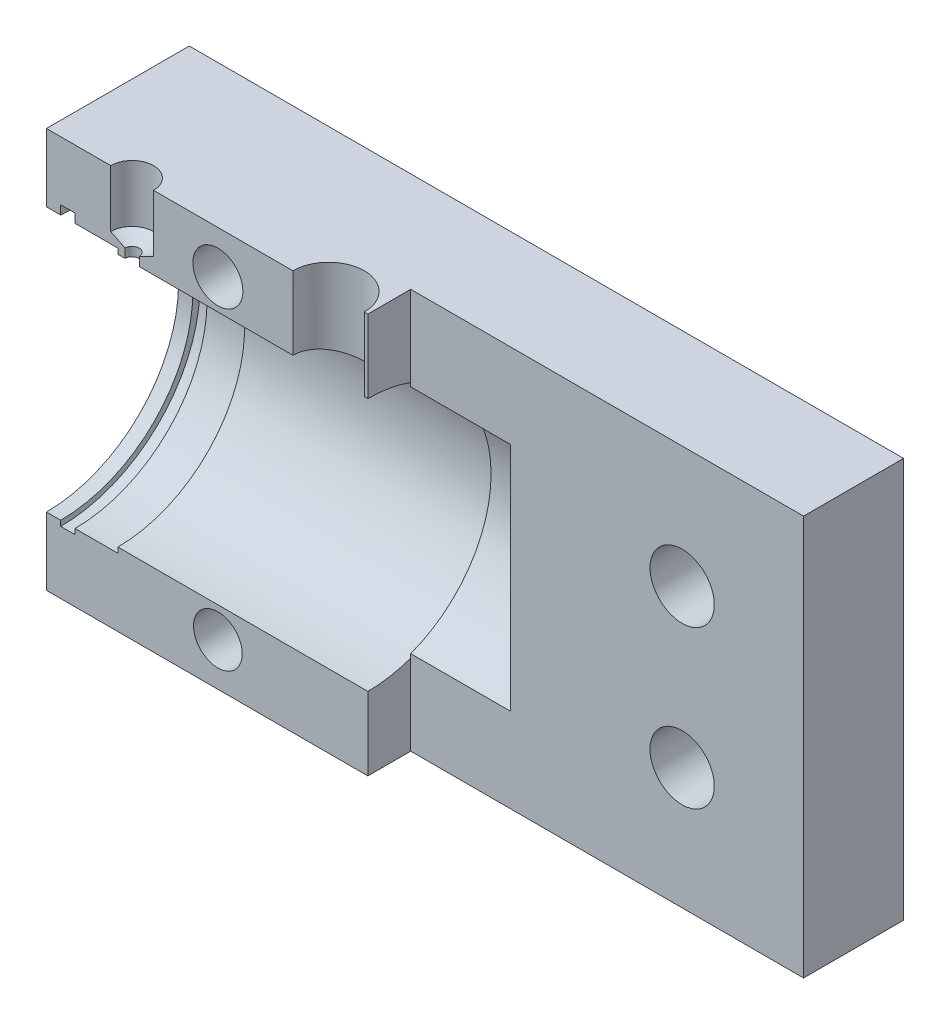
ISO-10303-21;
HEADER;
FILE_DESCRIPTION(('STEP AP214'),'2;1');
FILE_NAME('part.step','',(''),(''),'','','');
FILE_SCHEMA(('AUTOMOTIVE_DESIGN { 1 0 10303 214 1 1 1 1 }'));
ENDSEC;
DATA;
#1=APPLICATION_CONTEXT('core data for automotive mechanical design processes');
#2=APPLICATION_PROTOCOL_DEFINITION('international standard','automotive_design',2000,#1);
#3=PRODUCT_CONTEXT('',#1,'mechanical');
#4=PRODUCT('Part','Part','',(#3));
#5=PRODUCT_RELATED_PRODUCT_CATEGORY('part','',(#4));
#6=PRODUCT_DEFINITION_FORMATION('','',#4);
#7=PRODUCT_DEFINITION_CONTEXT('part definition',#1,'design');
#8=PRODUCT_DEFINITION('design','',#6,#7);
#9=PRODUCT_DEFINITION_SHAPE('','',#8);
#10=(LENGTH_UNIT() NAMED_UNIT(*) SI_UNIT(.MILLI.,.METRE.));
#11=(NAMED_UNIT(*) PLANE_ANGLE_UNIT() SI_UNIT($,.RADIAN.));
#12=(NAMED_UNIT(*) SI_UNIT($,.STERADIAN.) SOLID_ANGLE_UNIT());
#13=UNCERTAINTY_MEASURE_WITH_UNIT(LENGTH_MEASURE(1.E-05),#10,'distance_accuracy_value','');
#14=(GEOMETRIC_REPRESENTATION_CONTEXT(3) GLOBAL_UNCERTAINTY_ASSIGNED_CONTEXT((#13)) GLOBAL_UNIT_ASSIGNED_CONTEXT((#10,
#11,#12)) REPRESENTATION_CONTEXT('',''));
#15=CARTESIAN_POINT('',(0.,0.,0.));
#16=DIRECTION('',(0.,0.,1.));
#17=DIRECTION('',(1.,0.,0.));
#18=AXIS2_PLACEMENT_3D('',#15,#16,#17);
#19=CARTESIAN_POINT('',(-30.,40.,40.));
#20=DIRECTION('',(1.,0.,0.));
#21=DIRECTION('',(0.,0.,-1.));
#22=AXIS2_PLACEMENT_3D('',#19,#20,#21);
#23=PLANE('',#22);
#24=DIRECTION('',(0.,0.,-1.));
#25=VECTOR('',#24,1.);
#26=CARTESIAN_POINT('',(-30.,-16.,40.));
#27=LINE('',#26,#25);
#28=CARTESIAN_POINT('',(-30.,-16.,20.));
#29=VERTEX_POINT('',#28);
#30=CARTESIAN_POINT('',(-30.,-16.,0.));
#31=VERTEX_POINT('',#30);
#32=EDGE_CURVE('E258',#29,#31,#27,.T.);
#33=ORIENTED_EDGE('',*,*,#32,.F.);
#34=DIRECTION('',(0.,-1.,0.));
#35=VECTOR('',#34,1.);
#36=CARTESIAN_POINT('',(-30.,40.,20.));
#37=LINE('',#36,#35);
#38=CARTESIAN_POINT('',(-30.,-6.49999999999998,20.));
#39=VERTEX_POINT('',#38);
#40=EDGE_CURVE('E333',#39,#29,#37,.T.);
#41=ORIENTED_EDGE('',*,*,#40,.F.);
#42=CARTESIAN_POINT('',(-30.,12.,20.));
#43=DIRECTION('',(-1.,0.,0.));
#44=DIRECTION('',(0.,0.,1.));
#45=AXIS2_PLACEMENT_3D('',#42,#43,#44);
#46=CIRCLE('',#45,18.5);
#47=CARTESIAN_POINT('',(-30.,30.5,20.));
#48=VERTEX_POINT('',#47);
#49=EDGE_CURVE('E229',#48,#39,#46,.T.);
#50=ORIENTED_EDGE('',*,*,#49,.F.);
#51=CARTESIAN_POINT('',(-30.,40.,20.));
#52=VERTEX_POINT('',#51);
#53=EDGE_CURVE('E330',#52,#48,#37,.T.);
#54=ORIENTED_EDGE('',*,*,#53,.F.);
#55=DIRECTION('',(0.,0.,-1.));
#56=VECTOR('',#55,1.);
#57=CARTESIAN_POINT('',(-30.,40.,40.));
#58=LINE('',#57,#56);
#59=CARTESIAN_POINT('',(-30.,40.,0.));
#60=VERTEX_POINT('',#59);
#61=EDGE_CURVE('E252',#52,#60,#58,.T.);
#62=ORIENTED_EDGE('',*,*,#61,.T.);
#63=DIRECTION('',(0.,-1.,0.));
#64=VECTOR('',#63,1.);
#65=CARTESIAN_POINT('',(-30.,40.,0.));
#66=LINE('',#65,#64);
#67=EDGE_CURVE('E238',#60,#31,#66,.T.);
#68=ORIENTED_EDGE('',*,*,#67,.T.);
#69=EDGE_LOOP('',(#33,#41,#50,#54,#62,#68));
#70=FACE_BOUND('',#69,.T.);
#71=CARTESIAN_POINT('',(-30.,34.,6.));
#72=DIRECTION('',(-1.,0.,0.));
#73=DIRECTION('',(0.,0.,1.));
#74=AXIS2_PLACEMENT_3D('',#71,#72,#73);
#75=CIRCLE('',#74,2.5);
#76=CARTESIAN_POINT('',(-30.,34.,8.5));
#77=VERTEX_POINT('',#76);
#78=EDGE_CURVE('E509',#77,#77,#75,.T.);
#79=ORIENTED_EDGE('',*,*,#78,.F.);
#80=EDGE_LOOP('',(#79));
#81=FACE_BOUND('',#80,.T.);
#82=CARTESIAN_POINT('',(-30.,-9.99999999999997,6.));
#83=DIRECTION('',(1.,0.,0.));
#84=DIRECTION('',(0.,0.,-1.));
#85=AXIS2_PLACEMENT_3D('',#82,#83,#84);
#86=CIRCLE('',#85,2.5);
#87=CARTESIAN_POINT('',(-30.,-9.99999999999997,3.5));
#88=VERTEX_POINT('',#87);
#89=EDGE_CURVE('E515',#88,#88,#86,.T.);
#90=ORIENTED_EDGE('',*,*,#89,.T.);
#91=EDGE_LOOP('',(#90));
#92=FACE_BOUND('',#91,.T.);
#93=ADVANCED_FACE('F24',(#70,#81,#92),#23,.F.);
#94=CARTESIAN_POINT('',(53.,1.,0.));
#95=DIRECTION('',(0.,0.,1.));
#96=DIRECTION('',(1.,0.,0.));
#97=AXIS2_PLACEMENT_3D('',#94,#95,#96);
#98=CYLINDRICAL_SURFACE('',#97,4.5);
#99=CARTESIAN_POINT('',(53.,1.,14.));
#100=DIRECTION('',(0.,0.,-1.));
#101=DIRECTION('',(-1.,0.,0.));
#102=AXIS2_PLACEMENT_3D('',#99,#100,#101);
#103=CIRCLE('',#102,4.5);
#104=CARTESIAN_POINT('',(48.5,1.,14.));
#105=VERTEX_POINT('',#104);
#106=EDGE_CURVE('E223',#105,#105,#103,.F.);
#107=ORIENTED_EDGE('',*,*,#106,.T.);
#108=EDGE_LOOP('',(#107));
#109=FACE_BOUND('',#108,.T.);
#110=CARTESIAN_POINT('',(53.,1.,5.));
#111=DIRECTION('',(0.,0.,-1.));
#112=DIRECTION('',(-1.,0.,0.));
#113=AXIS2_PLACEMENT_3D('',#110,#111,#112);
#114=CIRCLE('',#113,4.5);
#115=CARTESIAN_POINT('',(48.5,1.,5.));
#116=VERTEX_POINT('',#115);
#117=EDGE_CURVE('E282',#116,#116,#114,.F.);
#118=ORIENTED_EDGE('',*,*,#117,.F.);
#119=EDGE_LOOP('',(#118));
#120=FACE_BOUND('',#119,.T.);
#121=ADVANCED_FACE('F396',(#109,#120),#98,.F.);
#122=CARTESIAN_POINT('',(53.,23.,0.));
#123=DIRECTION('',(0.,0.,1.));
#124=DIRECTION('',(1.,0.,0.));
#125=AXIS2_PLACEMENT_3D('',#122,#123,#124);
#126=CYLINDRICAL_SURFACE('',#125,4.5);
#127=CARTESIAN_POINT('',(53.,23.,14.));
#128=DIRECTION('',(0.,0.,-1.));
#129=DIRECTION('',(-1.,0.,0.));
#130=AXIS2_PLACEMENT_3D('',#127,#128,#129);
#131=CIRCLE('',#130,4.5);
#132=CARTESIAN_POINT('',(48.5,23.,14.));
#133=VERTEX_POINT('',#132);
#134=EDGE_CURVE('E226',#133,#133,#131,.F.);
#135=ORIENTED_EDGE('',*,*,#134,.T.);
#136=EDGE_LOOP('',(#135));
#137=FACE_BOUND('',#136,.T.);
#138=CARTESIAN_POINT('',(53.,23.,5.));
#139=DIRECTION('',(0.,0.,-1.));
#140=DIRECTION('',(-1.,0.,0.));
#141=AXIS2_PLACEMENT_3D('',#138,#139,#140);
#142=CIRCLE('',#141,4.5);
#143=CARTESIAN_POINT('',(48.5,23.,5.));
#144=VERTEX_POINT('',#143);
#145=EDGE_CURVE('E277',#144,#144,#142,.F.);
#146=ORIENTED_EDGE('',*,*,#145,.F.);
#147=EDGE_LOOP('',(#146));
#148=FACE_BOUND('',#147,.T.);
#149=ADVANCED_FACE('F402',(#137,#148),#126,.F.);
#150=CARTESIAN_POINT('',(-20.,12.,20.));
#151=DIRECTION('',(-1.,0.,0.));
#152=DIRECTION('',(0.,0.,1.));
#153=AXIS2_PLACEMENT_3D('',#150,#151,#152);
#154=CYLINDRICAL_SURFACE('',#153,18.5);
#155=CARTESIAN_POINT('',(-26.,12.,20.));
#156=DIRECTION('',(-1.,0.,0.));
#157=DIRECTION('',(0.,0.,1.));
#158=AXIS2_PLACEMENT_3D('',#155,#156,#157);
#159=CIRCLE('',#158,18.5);
#160=CARTESIAN_POINT('',(-26.,-6.49999999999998,20.0000000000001));
#161=VERTEX_POINT('',#160);
#162=CARTESIAN_POINT('',(-26.,30.5,20.));
#163=VERTEX_POINT('',#162);
#164=EDGE_CURVE('E440',#161,#163,#159,.F.);
#165=ORIENTED_EDGE('',*,*,#164,.F.);
#166=DIRECTION('',(-1.,0.,0.));
#167=VECTOR('',#166,1.);
#168=CARTESIAN_POINT('',(-20.,-6.49999999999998,20.));
#169=LINE('',#168,#167);
#170=CARTESIAN_POINT('',(-20.,-6.49999999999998,20.));
#171=VERTEX_POINT('',#170);
#172=EDGE_CURVE('E303',#161,#171,#169,.F.);
#173=ORIENTED_EDGE('',*,*,#172,.T.);
#174=CARTESIAN_POINT('',(-20.,12.,20.));
#175=DIRECTION('',(-1.,0.,0.));
#176=DIRECTION('',(0.,0.,1.));
#177=AXIS2_PLACEMENT_3D('',#174,#175,#176);
#178=CIRCLE('',#177,18.5);
#179=CARTESIAN_POINT('',(-20.,30.5,20.));
#180=VERTEX_POINT('',#179);
#181=EDGE_CURVE('E232',#180,#171,#178,.T.);
#182=ORIENTED_EDGE('',*,*,#181,.F.);
#183=DIRECTION('',(-1.,0.,0.));
#184=VECTOR('',#183,1.);
#185=CARTESIAN_POINT('',(-20.,30.5,20.));
#186=LINE('',#185,#184);
#187=EDGE_CURVE('E311',#180,#163,#186,.T.);
#188=ORIENTED_EDGE('',*,*,#187,.T.);
#189=EDGE_LOOP('',(#165,#173,#182,#188));
#190=FACE_BOUND('',#189,.T.);
#191=ADVANCED_FACE('F387',(#190),#154,.F.);
#192=CARTESIAN_POINT('',(-30.,-16.,20.));
#193=DIRECTION('',(0.,0.,-1.));
#194=DIRECTION('',(-1.,0.,0.));
#195=AXIS2_PLACEMENT_3D('',#192,#193,#194);
#196=PLANE('',#195);
#197=CARTESIAN_POINT('',(-6.,34.,20.));
#198=DIRECTION('',(0.,0.,1.));
#199=DIRECTION('',(1.,0.,0.));
#200=AXIS2_PLACEMENT_3D('',#197,#198,#199);
#201=CIRCLE('',#200,3.5);
#202=CARTESIAN_POINT('',(-2.5,34.,20.));
#203=VERTEX_POINT('',#202);
#204=EDGE_CURVE('E497',#203,#203,#201,.T.);
#205=ORIENTED_EDGE('',*,*,#204,.F.);
#206=EDGE_LOOP('',(#205));
#207=FACE_BOUND('',#206,.T.);
#208=DIRECTION('',(0.,1.,0.));
#209=VECTOR('',#208,1.);
#210=CARTESIAN_POINT('',(-15.,32.,20.));
#211=LINE('',#210,#209);
#212=CARTESIAN_POINT('',(-15.,40.,20.));
#213=VERTEX_POINT('',#212);
#214=CARTESIAN_POINT('',(-15.,32.,20.));
#215=VERTEX_POINT('',#214);
#216=EDGE_CURVE('E265',#213,#215,#211,.F.);
#217=ORIENTED_EDGE('',*,*,#216,.T.);
#218=DIRECTION('',(-0.894427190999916,-0.447213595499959,0.));
#219=VECTOR('',#218,1.);
#220=CARTESIAN_POINT('',(-15.,32.,20.));
#221=LINE('',#220,#219);
#222=CARTESIAN_POINT('',(-17.,31.,20.));
#223=VERTEX_POINT('',#222);
#224=EDGE_CURVE('E469',#215,#223,#221,.T.);
#225=ORIENTED_EDGE('',*,*,#224,.T.);
#226=DIRECTION('',(0.,1.,0.));
#227=VECTOR('',#226,1.);
#228=CARTESIAN_POINT('',(-17.,24.,20.));
#229=LINE('',#228,#227);
#230=CARTESIAN_POINT('',(-17.,29.75,20.));
#231=VERTEX_POINT('',#230);
#232=EDGE_CURVE('E348',#223,#231,#229,.F.);
#233=ORIENTED_EDGE('',*,*,#232,.T.);
#234=DIRECTION('',(-1.,0.,0.));
#235=VECTOR('',#234,1.);
#236=CARTESIAN_POINT('',(15.,29.75,20.));
#237=LINE('',#236,#235);
#238=CARTESIAN_POINT('',(4.5,29.75,20.));
#239=VERTEX_POINT('',#238);
#240=EDGE_CURVE('E321',#239,#231,#237,.T.);
#241=ORIENTED_EDGE('',*,*,#240,.F.);
#242=DIRECTION('',(0.,1.,0.));
#243=VECTOR('',#242,1.);
#244=CARTESIAN_POINT('',(4.50000000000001,26.,20.));
#245=LINE('',#244,#243);
#246=CARTESIAN_POINT('',(4.50000000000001,40.,20.));
#247=VERTEX_POINT('',#246);
#248=EDGE_CURVE('E274',#239,#247,#245,.T.);
#249=ORIENTED_EDGE('',*,*,#248,.T.);
#250=DIRECTION('',(1.,0.,0.));
#251=VECTOR('',#250,1.);
#252=CARTESIAN_POINT('',(-30.,40.,20.));
#253=LINE('',#252,#251);
#254=EDGE_CURVE('E326',#213,#247,#253,.T.);
#255=ORIENTED_EDGE('',*,*,#254,.F.);
#256=EDGE_LOOP('',(#217,#225,#233,#241,#249,#255));
#257=FACE_BOUND('',#256,.T.);
#258=ADVANCED_FACE('F372',(#207,#257),#196,.F.);
#259=DIRECTION('',(0.,1.,0.));
#260=VECTOR('',#259,1.);
#261=CARTESIAN_POINT('',(-19.,24.,20.));
#262=LINE('',#261,#260);
#263=CARTESIAN_POINT('',(-19.,29.75,20.));
#264=VERTEX_POINT('',#263);
#265=CARTESIAN_POINT('',(-19.,31.,20.));
#266=VERTEX_POINT('',#265);
#267=EDGE_CURVE('E338',#264,#266,#262,.T.);
#268=ORIENTED_EDGE('',*,*,#267,.T.);
#269=DIRECTION('',(0.894427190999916,-0.447213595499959,0.));
#270=VECTOR('',#269,1.);
#271=CARTESIAN_POINT('',(-21.,32.,20.));
#272=LINE('',#271,#270);
#273=CARTESIAN_POINT('',(-21.,32.,20.));
#274=VERTEX_POINT('',#273);
#275=EDGE_CURVE('E46',#274,#266,#272,.T.);
#276=ORIENTED_EDGE('',*,*,#275,.F.);
#277=DIRECTION('',(0.,1.,0.));
#278=VECTOR('',#277,1.);
#279=CARTESIAN_POINT('',(-21.,32.,20.));
#280=LINE('',#279,#278);
#281=CARTESIAN_POINT('',(-21.,40.,20.));
#282=VERTEX_POINT('',#281);
#283=EDGE_CURVE('E268',#274,#282,#280,.T.);
#284=ORIENTED_EDGE('',*,*,#283,.T.);
#285=EDGE_CURVE('E323',#52,#282,#253,.T.);
#286=ORIENTED_EDGE('',*,*,#285,.F.);
#287=ORIENTED_EDGE('',*,*,#53,.T.);
#288=CARTESIAN_POINT('',(-28.,30.5,20.));
#289=VERTEX_POINT('',#288);
#290=EDGE_CURVE('E314',#289,#48,#186,.T.);
#291=ORIENTED_EDGE('',*,*,#290,.F.);
#292=DIRECTION('',(0.,-1.,0.));
#293=VECTOR('',#292,1.);
#294=CARTESIAN_POINT('',(-28.,31.75,20.));
#295=LINE('',#294,#293);
#296=CARTESIAN_POINT('',(-28.,31.75,20.));
#297=VERTEX_POINT('',#296);
#298=EDGE_CURVE('E447',#297,#289,#295,.T.);
#299=ORIENTED_EDGE('',*,*,#298,.F.);
#300=DIRECTION('',(1.,0.,0.));
#301=VECTOR('',#300,1.);
#302=CARTESIAN_POINT('',(-28.,31.75,20.));
#303=LINE('',#302,#301);
#304=CARTESIAN_POINT('',(-26.,31.75,20.));
#305=VERTEX_POINT('',#304);
#306=EDGE_CURVE('E451',#297,#305,#303,.T.);
#307=ORIENTED_EDGE('',*,*,#306,.T.);
#308=DIRECTION('',(0.,-1.,0.));
#309=VECTOR('',#308,1.);
#310=CARTESIAN_POINT('',(-26.,31.75,20.));
#311=LINE('',#310,#309);
#312=EDGE_CURVE('E280',#305,#163,#311,.T.);
#313=ORIENTED_EDGE('',*,*,#312,.T.);
#314=ORIENTED_EDGE('',*,*,#187,.F.);
#315=DIRECTION('',(0.,-1.,0.));
#316=VECTOR('',#315,1.);
#317=CARTESIAN_POINT('',(-20.,12.,20.));
#318=LINE('',#317,#316);
#319=CARTESIAN_POINT('',(-20.,29.75,20.));
#320=VERTEX_POINT('',#319);
#321=EDGE_CURVE('E315',#180,#320,#318,.T.);
#322=ORIENTED_EDGE('',*,*,#321,.T.);
#323=EDGE_CURVE('E322',#264,#320,#237,.T.);
#324=ORIENTED_EDGE('',*,*,#323,.F.);
#325=EDGE_LOOP('',(#268,#276,#284,#286,#287,#291,#299,#307,#313,#314,#322,#324));
#326=FACE_BOUND('',#325,.T.);
#327=ADVANCED_FACE('F394',(#326),#196,.F.);
#328=CARTESIAN_POINT('',(70.,-16.,40.));
#329=DIRECTION('',(-1.,0.,0.));
#330=DIRECTION('',(0.,0.,1.));
#331=AXIS2_PLACEMENT_3D('',#328,#329,#330);
#332=PLANE('',#331);
#333=DIRECTION('',(0.,0.,-1.));
#334=VECTOR('',#333,1.);
#335=CARTESIAN_POINT('',(70.,40.,40.));
#336=LINE('',#335,#334);
#337=CARTESIAN_POINT('',(70.,40.,14.));
#338=VERTEX_POINT('',#337);
#339=CARTESIAN_POINT('',(70.,40.,0.));
#340=VERTEX_POINT('',#339);
#341=EDGE_CURVE('E254',#338,#340,#336,.T.);
#342=ORIENTED_EDGE('',*,*,#341,.F.);
#343=DIRECTION('',(0.,1.,0.));
#344=VECTOR('',#343,1.);
#345=CARTESIAN_POINT('',(70.,-16.,14.));
#346=LINE('',#345,#344);
#347=CARTESIAN_POINT('',(70.,-16.,14.));
#348=VERTEX_POINT('',#347);
#349=EDGE_CURVE('E203',#348,#338,#346,.T.);
#350=ORIENTED_EDGE('',*,*,#349,.F.);
#351=DIRECTION('',(0.,0.,-1.));
#352=VECTOR('',#351,1.);
#353=CARTESIAN_POINT('',(70.,-16.,40.));
#354=LINE('',#353,#352);
#355=CARTESIAN_POINT('',(70.,-16.,0.));
#356=VERTEX_POINT('',#355);
#357=EDGE_CURVE('E256',#348,#356,#354,.T.);
#358=ORIENTED_EDGE('',*,*,#357,.T.);
#359=DIRECTION('',(0.,1.,0.));
#360=VECTOR('',#359,1.);
#361=CARTESIAN_POINT('',(70.,-16.,0.));
#362=LINE('',#361,#360);
#363=EDGE_CURVE('E246',#356,#340,#362,.T.);
#364=ORIENTED_EDGE('',*,*,#363,.T.);
#365=EDGE_LOOP('',(#342,#350,#358,#364));
#366=FACE_BOUND('',#365,.T.);
#367=ADVANCED_FACE('F300',(#366),#332,.F.);
#368=CARTESIAN_POINT('',(15.,12.,20.));
#369=DIRECTION('',(-1.,0.,0.));
#370=DIRECTION('',(0.,0.,1.));
#371=AXIS2_PLACEMENT_3D('',#368,#369,#370);
#372=PLANE('',#371);
#373=CARTESIAN_POINT('',(15.,12.,20.));
#374=DIRECTION('',(-1.,0.,0.));
#375=DIRECTION('',(0.,0.,1.));
#376=AXIS2_PLACEMENT_3D('',#373,#374,#375);
#377=CIRCLE('',#376,17.25);
#378=CARTESIAN_POINT('',(15.,28.1728939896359,14.));
#379=VERTEX_POINT('',#378);
#380=CARTESIAN_POINT('',(15.,-4.17289398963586,14.));
#381=VERTEX_POINT('',#380);
#382=EDGE_CURVE('E180',#379,#381,#377,.T.);
#383=ORIENTED_EDGE('',*,*,#382,.F.);
#384=DIRECTION('',(0.,1.,0.));
#385=VECTOR('',#384,1.);
#386=CARTESIAN_POINT('',(15.,-16.,14.));
#387=LINE('',#386,#385);
#388=CARTESIAN_POINT('',(15.,28.7051638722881,14.));
#389=VERTEX_POINT('',#388);
#390=EDGE_CURVE('E189',#379,#389,#387,.T.);
#391=ORIENTED_EDGE('',*,*,#390,.T.);
#392=CARTESIAN_POINT('',(15.,12.,20.));
#393=DIRECTION('',(-1.,0.,0.));
#394=DIRECTION('',(0.,0.,1.));
#395=AXIS2_PLACEMENT_3D('',#392,#393,#394);
#396=CIRCLE('',#395,17.75);
#397=CARTESIAN_POINT('',(15.,-4.7051638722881,14.));
#398=VERTEX_POINT('',#397);
#399=EDGE_CURVE('E239',#389,#398,#396,.T.);
#400=ORIENTED_EDGE('',*,*,#399,.T.);
#401=EDGE_CURVE('E191',#398,#381,#387,.T.);
#402=ORIENTED_EDGE('',*,*,#401,.T.);
#403=EDGE_LOOP('',(#383,#391,#400,#402));
#404=FACE_BOUND('',#403,.T.);
#405=ADVANCED_FACE('F187',(#404),#372,.T.);
#406=CARTESIAN_POINT('',(70.,-16.,40.));
#407=DIRECTION('',(0.,-1.,0.));
#408=DIRECTION('',(1.,0.,0.));
#409=AXIS2_PLACEMENT_3D('',#406,#407,#408);
#410=PLANE('',#409);
#411=DIRECTION('',(-1.,0.,0.));
#412=VECTOR('',#411,1.);
#413=CARTESIAN_POINT('',(70.,-16.,20.));
#414=LINE('',#413,#412);
#415=CARTESIAN_POINT('',(15.,-16.,20.));
#416=VERTEX_POINT('',#415);
#417=EDGE_CURVE('E328',#416,#29,#414,.T.);
#418=ORIENTED_EDGE('',*,*,#417,.T.);
#419=ORIENTED_EDGE('',*,*,#32,.T.);
#420=DIRECTION('',(-1.,0.,0.));
#421=VECTOR('',#420,1.);
#422=CARTESIAN_POINT('',(70.,-16.,0.));
#423=LINE('',#422,#421);
#424=EDGE_CURVE('E243',#356,#31,#423,.T.);
#425=ORIENTED_EDGE('',*,*,#424,.F.);
#426=ORIENTED_EDGE('',*,*,#357,.F.);
#427=DIRECTION('',(1.,0.,0.));
#428=VECTOR('',#427,1.);
#429=CARTESIAN_POINT('',(15.,-16.,14.));
#430=LINE('',#429,#428);
#431=CARTESIAN_POINT('',(15.,-16.,14.));
#432=VERTEX_POINT('',#431);
#433=EDGE_CURVE('E221',#432,#348,#430,.T.);
#434=ORIENTED_EDGE('',*,*,#433,.F.);
#435=DIRECTION('',(0.,0.,1.));
#436=VECTOR('',#435,1.);
#437=CARTESIAN_POINT('',(15.,-16.,14.));
#438=LINE('',#437,#436);
#439=EDGE_CURVE('E212',#432,#416,#438,.T.);
#440=ORIENTED_EDGE('',*,*,#439,.T.);
#441=EDGE_LOOP('',(#418,#419,#425,#426,#434,#440));
#442=FACE_BOUND('',#441,.T.);
#443=ADVANCED_FACE('F26',(#442),#410,.T.);
#444=CARTESIAN_POINT('',(-30.,40.,40.));
#445=DIRECTION('',(0.,1.,0.));
#446=DIRECTION('',(0.,0.,1.));
#447=AXIS2_PLACEMENT_3D('',#444,#445,#446);
#448=PLANE('',#447);
#449=CARTESIAN_POINT('',(9.50000000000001,40.,20.));
#450=DIRECTION('',(0.,1.,0.));
#451=DIRECTION('',(0.,0.,1.));
#452=AXIS2_PLACEMENT_3D('',#449,#450,#451);
#453=CIRCLE('',#452,5.);
#454=CARTESIAN_POINT('',(14.5,40.,20.));
#455=VERTEX_POINT('',#454);
#456=EDGE_CURVE('E416',#455,#247,#453,.T.);
#457=ORIENTED_EDGE('',*,*,#456,.F.);
#458=CARTESIAN_POINT('',(15.,40.,20.));
#459=VERTEX_POINT('',#458);
#460=EDGE_CURVE('E327',#455,#459,#253,.T.);
#461=ORIENTED_EDGE('',*,*,#460,.T.);
#462=DIRECTION('',(0.,0.,-1.));
#463=VECTOR('',#462,1.);
#464=CARTESIAN_POINT('',(15.,40.,26.));
#465=LINE('',#464,#463);
#466=CARTESIAN_POINT('',(15.,40.,14.));
#467=VERTEX_POINT('',#466);
#468=EDGE_CURVE('E207',#459,#467,#465,.T.);
#469=ORIENTED_EDGE('',*,*,#468,.T.);
#470=DIRECTION('',(1.,0.,0.));
#471=VECTOR('',#470,1.);
#472=CARTESIAN_POINT('',(15.,40.,14.));
#473=LINE('',#472,#471);
#474=EDGE_CURVE('E217',#467,#338,#473,.T.);
#475=ORIENTED_EDGE('',*,*,#474,.T.);
#476=ORIENTED_EDGE('',*,*,#341,.T.);
#477=DIRECTION('',(1.,0.,0.));
#478=VECTOR('',#477,1.);
#479=CARTESIAN_POINT('',(-30.,40.,0.));
#480=LINE('',#479,#478);
#481=EDGE_CURVE('E249',#60,#340,#480,.T.);
#482=ORIENTED_EDGE('',*,*,#481,.F.);
#483=ORIENTED_EDGE('',*,*,#61,.F.);
#484=ORIENTED_EDGE('',*,*,#285,.T.);
#485=CARTESIAN_POINT('',(-18.,40.,20.));
#486=DIRECTION('',(0.,1.,0.));
#487=DIRECTION('',(0.,0.,1.));
#488=AXIS2_PLACEMENT_3D('',#485,#486,#487);
#489=CIRCLE('',#488,3.);
#490=EDGE_CURVE('E336',#213,#282,#489,.T.);
#491=ORIENTED_EDGE('',*,*,#490,.F.);
#492=ORIENTED_EDGE('',*,*,#254,.T.);
#493=EDGE_LOOP('',(#457,#461,#469,#475,#476,#482,#483,#484,#491,#492));
#494=FACE_BOUND('',#493,.T.);
#495=ADVANCED_FACE('F393',(#494),#448,.T.);
#496=CARTESIAN_POINT('',(-30.,40.,0.));
#497=DIRECTION('',(0.,0.,1.));
#498=DIRECTION('',(1.,0.,0.));
#499=AXIS2_PLACEMENT_3D('',#496,#497,#498);
#500=PLANE('',#499);
#501=CARTESIAN_POINT('',(-6.,-10.,0.));
#502=DIRECTION('',(0.,0.,1.));
#503=DIRECTION('',(1.,0.,0.));
#504=AXIS2_PLACEMENT_3D('',#501,#502,#503);
#505=CIRCLE('',#504,3.41030165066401);
#506=CARTESIAN_POINT('',(-2.58969834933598,-10.,0.));
#507=VERTEX_POINT('',#506);
#508=EDGE_CURVE('E500',#507,#507,#505,.T.);
#509=ORIENTED_EDGE('',*,*,#508,.T.);
#510=EDGE_LOOP('',(#509));
#511=FACE_BOUND('',#510,.T.);
#512=CARTESIAN_POINT('',(-6.,34.,0.));
#513=DIRECTION('',(0.,0.,1.));
#514=DIRECTION('',(1.,0.,0.));
#515=AXIS2_PLACEMENT_3D('',#512,#513,#514);
#516=CIRCLE('',#515,3.5);
#517=CARTESIAN_POINT('',(-2.5,34.,0.));
#518=VERTEX_POINT('',#517);
#519=EDGE_CURVE('E494',#518,#518,#516,.T.);
#520=ORIENTED_EDGE('',*,*,#519,.T.);
#521=EDGE_LOOP('',(#520));
#522=FACE_BOUND('',#521,.T.);
#523=CARTESIAN_POINT('',(53.,1.,0.));
#524=DIRECTION('',(0.,0.,-1.));
#525=DIRECTION('',(-1.,0.,0.));
#526=AXIS2_PLACEMENT_3D('',#523,#524,#525);
#527=CIRCLE('',#526,8.5);
#528=CARTESIAN_POINT('',(44.5,1.,0.));
#529=VERTEX_POINT('',#528);
#530=EDGE_CURVE('E488',#529,#529,#527,.T.);
#531=ORIENTED_EDGE('',*,*,#530,.F.);
#532=EDGE_LOOP('',(#531));
#533=FACE_BOUND('',#532,.T.);
#534=CARTESIAN_POINT('',(53.,23.,0.));
#535=DIRECTION('',(0.,0.,-1.));
#536=DIRECTION('',(-1.,0.,0.));
#537=AXIS2_PLACEMENT_3D('',#534,#535,#536);
#538=CIRCLE('',#537,8.5);
#539=CARTESIAN_POINT('',(44.5,23.,0.));
#540=VERTEX_POINT('',#539);
#541=EDGE_CURVE('E285',#540,#540,#538,.T.);
#542=ORIENTED_EDGE('',*,*,#541,.F.);
#543=EDGE_LOOP('',(#542));
#544=FACE_BOUND('',#543,.T.);
#545=ORIENTED_EDGE('',*,*,#67,.F.);
#546=ORIENTED_EDGE('',*,*,#481,.T.);
#547=ORIENTED_EDGE('',*,*,#363,.F.);
#548=ORIENTED_EDGE('',*,*,#424,.T.);
#549=EDGE_LOOP('',(#545,#546,#547,#548));
#550=FACE_BOUND('',#549,.T.);
#551=ADVANCED_FACE('F383',(#511,#522,#533,#544,#550),#500,.F.);
#552=CARTESIAN_POINT('',(-20.,12.,20.));
#553=DIRECTION('',(-1.,0.,0.));
#554=DIRECTION('',(0.,0.,1.));
#555=AXIS2_PLACEMENT_3D('',#552,#553,#554);
#556=PLANE('',#555);
#557=ORIENTED_EDGE('',*,*,#321,.F.);
#558=ORIENTED_EDGE('',*,*,#181,.T.);
#559=CARTESIAN_POINT('',(-20.,-5.74999999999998,20.));
#560=VERTEX_POINT('',#559);
#561=EDGE_CURVE('E309',#560,#171,#318,.T.);
#562=ORIENTED_EDGE('',*,*,#561,.F.);
#563=CARTESIAN_POINT('',(-20.,12.,20.));
#564=DIRECTION('',(-1.,0.,0.));
#565=DIRECTION('',(0.,0.,1.));
#566=AXIS2_PLACEMENT_3D('',#563,#564,#565);
#567=CIRCLE('',#566,17.75);
#568=EDGE_CURVE('E235',#560,#320,#567,.F.);
#569=ORIENTED_EDGE('',*,*,#568,.T.);
#570=EDGE_LOOP('',(#557,#558,#562,#569));
#571=FACE_BOUND('',#570,.T.);
#572=ADVANCED_FACE('F379',(#571),#556,.T.);
#573=CARTESIAN_POINT('',(-28.,-6.49999999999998,20.0000000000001));
#574=VERTEX_POINT('',#573);
#575=EDGE_CURVE('E301',#39,#574,#169,.F.);
#576=ORIENTED_EDGE('',*,*,#575,.T.);
#577=CARTESIAN_POINT('',(-28.,12.,20.));
#578=DIRECTION('',(-1.,0.,0.));
#579=DIRECTION('',(0.,0.,1.));
#580=AXIS2_PLACEMENT_3D('',#577,#578,#579);
#581=CIRCLE('',#580,18.5);
#582=EDGE_CURVE('E423',#574,#289,#581,.F.);
#583=ORIENTED_EDGE('',*,*,#582,.T.);
#584=ORIENTED_EDGE('',*,*,#290,.T.);
#585=ORIENTED_EDGE('',*,*,#49,.T.);
#586=EDGE_LOOP('',(#576,#583,#584,#585));
#587=FACE_BOUND('',#586,.T.);
#588=ADVANCED_FACE('F382',(#587),#154,.F.);
#589=CARTESIAN_POINT('',(15.,12.,20.));
#590=DIRECTION('',(-1.,0.,0.));
#591=DIRECTION('',(0.,0.,1.));
#592=AXIS2_PLACEMENT_3D('',#589,#590,#591);
#593=CYLINDRICAL_SURFACE('',#592,17.75);
#594=CARTESIAN_POINT('',(15.,29.75,20.));
#595=VERTEX_POINT('',#594);
#596=CARTESIAN_POINT('',(14.5,29.75,20.));
#597=VERTEX_POINT('',#596);
#598=EDGE_CURVE('E318',#595,#597,#237,.T.);
#599=ORIENTED_EDGE('',*,*,#598,.T.);
#600=CARTESIAN_POINT('',(9.50000000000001,29.0312213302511,25.));
#601=CARTESIAN_POINT('',(9.77480508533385,29.0312254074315,24.9999946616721));
#602=CARTESIAN_POINT('',(10.0496646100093,29.0379452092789,24.9772675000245));
#603=CARTESIAN_POINT('',(10.591402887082,29.0640063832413,24.8871583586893));
#604=CARTESIAN_POINT('',(10.8582781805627,29.0833531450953,24.8197573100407));
#605=CARTESIAN_POINT('',(11.3761308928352,29.1323070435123,24.6427264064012));
#606=CARTESIAN_POINT('',(11.6271317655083,29.1618986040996,24.5331606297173));
#607=CARTESIAN_POINT('',(12.1072389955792,29.2279875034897,24.2751157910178));
#608=CARTESIAN_POINT('',(12.3363429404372,29.2644856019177,24.1266324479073));
#609=CARTESIAN_POINT('',(12.7725451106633,29.3414168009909,23.790534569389));
#610=CARTESIAN_POINT('',(12.9789419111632,29.3819259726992,23.6020269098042));
#611=CARTESIAN_POINT('',(13.3576499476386,29.4616613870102,23.1931493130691));
#612=CARTESIAN_POINT('',(13.529957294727,29.5008874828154,22.9727757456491));
#613=CARTESIAN_POINT('',(13.8385728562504,29.574492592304,22.5015029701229));
#614=CARTESIAN_POINT('',(13.9741759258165,29.6087714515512,22.2501249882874));
#615=CARTESIAN_POINT('',(14.2009215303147,29.6677421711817,21.7270079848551));
#616=CARTESIAN_POINT('',(14.2920724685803,29.6924358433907,21.4552728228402));
#617=CARTESIAN_POINT('',(14.425033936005,29.7289158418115,20.9064841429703));
#618=CARTESIAN_POINT('',(14.4680394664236,29.7410142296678,20.6297412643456));
#619=CARTESIAN_POINT('',(14.5072573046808,29.7520350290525,20.0727217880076));
#620=CARTESIAN_POINT('',(14.5034783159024,29.7509598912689,19.7924458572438));
#621=CARTESIAN_POINT('',(14.4500587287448,29.7359799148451,19.2446625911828));
#622=CARTESIAN_POINT('',(14.4017104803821,29.7224366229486,18.977017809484));
#623=CARTESIAN_POINT('',(14.2626227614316,29.6844742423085,18.4538066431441));
#624=CARTESIAN_POINT('',(14.1718807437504,29.6600545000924,18.1982409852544));
#625=CARTESIAN_POINT('',(13.9496420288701,29.6025627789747,17.7032433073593));
#626=CARTESIAN_POINT('',(13.8177185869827,29.5694007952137,17.4640137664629));
#627=CARTESIAN_POINT('',(13.5171935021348,29.4979737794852,17.0106590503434));
#628=CARTESIAN_POINT('',(13.3485840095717,29.4597076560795,16.7965392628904));
#629=CARTESIAN_POINT('',(12.9726800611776,29.3806550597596,16.3917665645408));
#630=CARTESIAN_POINT('',(12.7642612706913,29.3398271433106,16.2021645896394));
#631=CARTESIAN_POINT('',(12.3181718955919,29.2614155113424,15.8603290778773));
#632=CARTESIAN_POINT('',(12.0804990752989,29.2238320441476,15.7080983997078));
#633=CARTESIAN_POINT('',(11.5801582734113,29.1559836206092,15.4444004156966));
#634=CARTESIAN_POINT('',(11.3173146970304,29.1257762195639,15.3332504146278));
#635=CARTESIAN_POINT('',(10.775601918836,29.0767987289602,15.1570773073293));
#636=CARTESIAN_POINT('',(10.4967372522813,29.0580254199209,15.092041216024));
#637=CARTESIAN_POINT('',(9.94080378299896,29.0347368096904,15.0118199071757));
#638=CARTESIAN_POINT('',(9.66398179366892,29.0297695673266,14.9950538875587));
#639=CARTESIAN_POINT('',(9.11148302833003,29.0334131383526,15.0074672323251));
#640=CARTESIAN_POINT('',(8.8358061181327,29.0420223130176,15.0366410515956));
#641=CARTESIAN_POINT('',(8.29972995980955,29.0714089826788,15.1387057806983));
#642=CARTESIAN_POINT('',(8.03912778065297,29.0919136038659,15.2106171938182));
#643=CARTESIAN_POINT('',(7.53369206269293,29.1425071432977,15.3949995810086));
#644=CARTESIAN_POINT('',(7.28886075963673,29.1725974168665,15.5074762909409));
#645=CARTESIAN_POINT('',(6.81538343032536,29.2398769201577,15.7729126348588));
#646=CARTESIAN_POINT('',(6.58727120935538,29.2772200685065,15.9267845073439));
#647=CARTESIAN_POINT('',(6.15952571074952,29.3544496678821,16.2695335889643));
#648=CARTESIAN_POINT('',(5.95989844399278,29.3943366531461,16.458418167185));
#649=CARTESIAN_POINT('',(5.58807445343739,29.4737385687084,16.873195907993));
#650=CARTESIAN_POINT('',(5.41698829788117,29.5131986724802,17.1000973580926));
#651=CARTESIAN_POINT('',(5.11531632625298,29.5859731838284,17.5803035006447));
#652=CARTESIAN_POINT('',(4.98472837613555,29.6192879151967,17.8336068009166));
#653=CARTESIAN_POINT('',(4.76899882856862,29.675804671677,18.3576605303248));
#654=CARTESIAN_POINT('',(4.68351334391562,29.6990829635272,18.6282607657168));
#655=CARTESIAN_POINT('',(4.5594604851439,29.7332406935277,19.1807485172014));
#656=CARTESIAN_POINT('',(4.52088140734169,29.7441232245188,19.462633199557));
#657=CARTESIAN_POINT('',(4.49253934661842,29.7520985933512,20.0193639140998));
#658=CARTESIAN_POINT('',(4.50115586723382,29.7496492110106,20.2941219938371));
#659=CARTESIAN_POINT('',(4.56314916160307,29.7322903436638,20.8381171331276));
#660=CARTESIAN_POINT('',(4.61652389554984,29.7173814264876,21.1073544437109));
#661=CARTESIAN_POINT('',(4.76556175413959,29.6768875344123,21.6304783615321));
#662=CARTESIAN_POINT('',(4.86086269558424,29.6513940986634,21.8844757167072));
#663=CARTESIAN_POINT('',(5.09072563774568,29.5923820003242,22.3730172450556));
#664=CARTESIAN_POINT('',(5.22529360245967,29.5588621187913,22.6075584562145));
#665=CARTESIAN_POINT('',(5.53442466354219,29.4861407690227,23.0579351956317));
#666=CARTESIAN_POINT('',(5.71003740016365,29.4468023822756,23.2730280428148));
#667=CARTESIAN_POINT('',(6.09432671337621,29.3673782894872,23.6712375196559));
#668=CARTESIAN_POINT('',(6.30301232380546,29.3272923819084,23.8543453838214));
#669=CARTESIAN_POINT('',(6.75387528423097,29.2497311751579,24.1880089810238));
#670=CARTESIAN_POINT('',(6.99676690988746,29.2123476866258,24.3376230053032));
#671=CARTESIAN_POINT('',(7.5052786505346,29.1457895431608,24.5936930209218));
#672=CARTESIAN_POINT('',(7.77088545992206,29.1166101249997,24.7001740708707));
#673=CARTESIAN_POINT('',(8.27913502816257,29.0733147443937,24.8548868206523));
#674=CARTESIAN_POINT('',(8.51982139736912,29.0576664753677,24.9091671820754));
#675=CARTESIAN_POINT('',(9.00699114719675,29.0366186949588,24.9817235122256));
#676=CARTESIAN_POINT('',(9.25347366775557,29.031217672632,25.0000047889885));
#677=CARTESIAN_POINT('',(9.50000000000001,29.0312213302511,25.));
#678=B_SPLINE_CURVE_WITH_KNOTS('',3,(#600,#601,#602,#603,#604,#605,#606,#607,#608,#609,#610,
#611,#612,#613,#614,#615,#616,#617,#618,#619,#620,#621,#622,#623,#624,#625,#626,#627,#628,#629,
#630,#631,#632,#633,#634,#635,#636,#637,#638,#639,#640,#641,#642,#643,#644,#645,#646,#647,#648,
#649,#650,#651,#652,#653,#654,#655,#656,#657,#658,#659,#660,#661,#662,#663,#664,#665,#666,#667,
#668,#669,#670,#671,#672,#673,#674,#675,#676,#677),.UNSPECIFIED.,.T.,.F.,(4,2,2,2,2,2,2,2,2,2,2,
2,2,2,2,2,2,2,2,2,2,2,2,2,2,2,2,2,2,2,2,2,2,2,2,2,2,2,4),(0.,0.823507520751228,1.64736678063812,
2.46997892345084,3.29268159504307,4.1361504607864,4.97971549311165,5.83849133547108,
6.69710476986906,7.53389863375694,8.37053683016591,9.18365360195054,9.99681923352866,
10.8187079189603,11.640772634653,12.4909072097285,13.341106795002,14.1977424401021,
15.0541367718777,15.8821469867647,16.7100572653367,17.5196872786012,18.329431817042,
19.1587357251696,19.9882143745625,20.8448196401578,21.7013797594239,22.551310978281,
23.4010300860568,24.2217603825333,25.0424532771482,25.8561916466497,26.6700536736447,
27.5075923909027,28.3453602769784,29.2043424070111,30.0628247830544,30.8016984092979,
31.5404630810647),.UNSPECIFIED.);
#679=EDGE_CURVE('E422',#597,#239,#678,.T.);
#680=ORIENTED_EDGE('',*,*,#679,.T.);
#681=ORIENTED_EDGE('',*,*,#240,.T.);
#682=CARTESIAN_POINT('',(-18.,29.7218085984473,21.));
#683=CARTESIAN_POINT('',(-17.9438774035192,29.7218089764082,20.9999975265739));
#684=CARTESIAN_POINT('',(-17.8877152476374,29.7220780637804,20.9952595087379));
#685=CARTESIAN_POINT('',(-17.77694095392,29.7231254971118,20.9764262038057));
#686=CARTESIAN_POINT('',(-17.7223307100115,29.7239044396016,20.9623199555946));
#687=CARTESIAN_POINT('',(-17.6162809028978,29.7258830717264,20.9251559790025));
#688=CARTESIAN_POINT('',(-17.5648397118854,29.7270825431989,20.9021028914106));
#689=CARTESIAN_POINT('',(-17.4665708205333,29.7297668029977,20.847706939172));
#690=CARTESIAN_POINT('',(-17.4197420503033,29.7312515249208,20.8163660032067));
#691=CARTESIAN_POINT('',(-17.3319551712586,29.7343410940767,20.7462408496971));
#692=CARTESIAN_POINT('',(-17.2910035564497,29.7359460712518,20.7074485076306));
#693=CARTESIAN_POINT('',(-17.2161889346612,29.7390940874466,20.6235382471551));
#694=CARTESIAN_POINT('',(-17.1823262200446,29.7406371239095,20.5784200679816));
#695=CARTESIAN_POINT('',(-17.1226316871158,29.7434884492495,20.4831035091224));
#696=CARTESIAN_POINT('',(-17.096805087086,29.7447965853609,20.4329018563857));
#697=CARTESIAN_POINT('',(-17.0539493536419,29.747029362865,20.3288663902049));
#698=CARTESIAN_POINT('',(-17.0369201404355,29.7479540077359,20.2750326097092));
#699=CARTESIAN_POINT('',(-17.01216017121,29.7493147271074,20.1653222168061));
#700=CARTESIAN_POINT('',(-17.0044194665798,29.7497513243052,20.1094478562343));
#701=CARTESIAN_POINT('',(-16.9984255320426,29.7500885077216,19.9971912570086));
#702=CARTESIAN_POINT('',(-17.0001722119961,29.7499890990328,19.9408090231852));
#703=CARTESIAN_POINT('',(-17.0130952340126,29.7492659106,19.8292045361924));
#704=CARTESIAN_POINT('',(-17.0242608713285,29.7486427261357,19.7739810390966));
#705=CARTESIAN_POINT('',(-17.0556882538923,29.7469428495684,19.6661934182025));
#706=CARTESIAN_POINT('',(-17.0759500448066,29.7458661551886,19.6136293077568));
#707=CARTESIAN_POINT('',(-17.1250067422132,29.7433794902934,19.512618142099));
#708=CARTESIAN_POINT('',(-17.1538065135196,29.741969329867,19.4641734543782));
#709=CARTESIAN_POINT('',(-17.2191181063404,29.7389744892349,19.372802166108));
#710=CARTESIAN_POINT('',(-17.2556299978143,29.7373898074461,19.3298756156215));
#711=CARTESIAN_POINT('',(-17.3353898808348,29.7342217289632,19.2506966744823));
#712=CARTESIAN_POINT('',(-17.378647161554,29.7326383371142,19.2144536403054));
#713=CARTESIAN_POINT('',(-17.470637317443,29.7296535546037,19.1497426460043));
#714=CARTESIAN_POINT('',(-17.519370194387,29.7282521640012,19.1212746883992));
#715=CARTESIAN_POINT('',(-17.6209339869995,29.72578959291,19.0729226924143));
#716=CARTESIAN_POINT('',(-17.6737650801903,29.7247284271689,19.053039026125));
#717=CARTESIAN_POINT('',(-17.7820229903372,29.7230665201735,19.0224263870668));
#718=CARTESIAN_POINT('',(-17.8374497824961,29.7224657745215,19.0116973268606));
#719=CARTESIAN_POINT('',(-17.9492441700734,29.7217932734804,18.9997100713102));
#720=CARTESIAN_POINT('',(-18.0056103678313,29.7217207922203,18.9984388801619));
#721=CARTESIAN_POINT('',(-18.1177552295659,29.7221110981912,19.0053695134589));
#722=CARTESIAN_POINT('',(-18.1735338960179,29.7225738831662,19.0135712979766));
#723=CARTESIAN_POINT('',(-18.2828837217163,29.7239819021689,19.0392042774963));
#724=CARTESIAN_POINT('',(-18.3364562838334,29.7249268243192,19.0566295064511));
#725=CARTESIAN_POINT('',(-18.4399164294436,29.72719235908,19.1002086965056));
#726=CARTESIAN_POINT('',(-18.4898039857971,29.7285129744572,19.1263627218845));
#727=CARTESIAN_POINT('',(-18.5845377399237,29.7313828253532,19.1866903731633));
#728=CARTESIAN_POINT('',(-18.6293783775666,29.7329323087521,19.2208727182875));
#729=CARTESIAN_POINT('',(-18.7126894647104,29.7360843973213,19.2962739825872));
#730=CARTESIAN_POINT('',(-18.7511598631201,29.7376870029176,19.337492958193));
#731=CARTESIAN_POINT('',(-18.8206822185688,29.7407668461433,19.4258533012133));
#732=CARTESIAN_POINT('',(-18.8517257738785,29.7422439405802,19.4730012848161));
#733=CARTESIAN_POINT('',(-18.905455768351,29.7449042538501,19.5718479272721));
#734=CARTESIAN_POINT('',(-18.928142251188,29.7460874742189,19.6235465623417));
#735=CARTESIAN_POINT('',(-18.9644994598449,29.748026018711,19.7299958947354));
#736=CARTESIAN_POINT('',(-18.9781755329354,29.7487815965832,19.7847447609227));
#737=CARTESIAN_POINT('',(-18.9961412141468,29.7497807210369,19.8957659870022));
#738=CARTESIAN_POINT('',(-19.0004308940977,29.7500242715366,19.9520383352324));
#739=CARTESIAN_POINT('',(-18.9995013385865,29.7499719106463,20.0644258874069));
#740=CARTESIAN_POINT('',(-18.994295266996,29.7496767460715,20.1205412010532));
#741=CARTESIAN_POINT('',(-18.9745492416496,29.7485816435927,20.2310996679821));
#742=CARTESIAN_POINT('',(-18.9600092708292,29.7477817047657,20.2855428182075));
#743=CARTESIAN_POINT('',(-18.9220110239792,29.7457670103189,20.3912138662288));
#744=CARTESIAN_POINT('',(-18.8985527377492,29.7445522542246,20.4424417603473));
#745=CARTESIAN_POINT('',(-18.8433857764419,29.7418444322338,20.5402332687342));
#746=CARTESIAN_POINT('',(-18.8116773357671,29.7403513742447,20.5867970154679));
#747=CARTESIAN_POINT('',(-18.7408621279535,29.7372525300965,20.6740048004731));
#748=CARTESIAN_POINT('',(-18.7017459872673,29.7356466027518,20.7146412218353));
#749=CARTESIAN_POINT('',(-18.6172356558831,29.7325040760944,20.788784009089));
#750=CARTESIAN_POINT('',(-18.5718399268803,29.730967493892,20.8222886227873));
#751=CARTESIAN_POINT('',(-18.4760156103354,29.7281357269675,20.8812367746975));
#752=CARTESIAN_POINT('',(-18.4255815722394,29.7268408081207,20.9066714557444));
#753=CARTESIAN_POINT('',(-18.3211888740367,29.7246424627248,20.9486813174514));
#754=CARTESIAN_POINT('',(-18.2672344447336,29.7237385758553,20.9652669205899));
#755=CARTESIAN_POINT('',(-18.1774560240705,29.7226625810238,20.9847763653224));
#756=CARTESIAN_POINT('',(-18.1422129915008,29.7223437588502,20.9904778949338));
#757=CARTESIAN_POINT('',(-18.0713186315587,29.7219166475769,20.9980904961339));
#758=CARTESIAN_POINT('',(-18.0356673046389,29.7218083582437,21.0000015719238));
#759=CARTESIAN_POINT('',(-18.,29.7218085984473,21.));
#760=B_SPLINE_CURVE_WITH_KNOTS('',3,(#682,#683,#684,#685,#686,#687,#688,#689,#690,#691,#692,
#693,#694,#695,#696,#697,#698,#699,#700,#701,#702,#703,#704,#705,#706,#707,#708,#709,#710,#711,
#712,#713,#714,#715,#716,#717,#718,#719,#720,#721,#722,#723,#724,#725,#726,#727,#728,#729,#730,
#731,#732,#733,#734,#735,#736,#737,#738,#739,#740,#741,#742,#743,#744,#745,#746,#747,#748,#749,
#750,#751,#752,#753,#754,#755,#756,#757,#758,#759),.UNSPECIFIED.,.T.,.F.,(4,2,2,2,2,2,2,2,2,2,2,
2,2,2,2,2,2,2,2,2,2,2,2,2,2,2,2,2,2,2,2,2,2,2,2,2,2,2,4),(0.,0.168237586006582,
0.336672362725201,0.505019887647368,0.673328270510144,0.841821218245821,1.01032111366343,
1.17893019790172,1.34753775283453,1.51596455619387,1.68438975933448,1.85262380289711,
2.020858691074,2.18918962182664,2.35752207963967,2.52608843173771,2.69465483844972,
2.86322855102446,3.03180065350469,3.20014108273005,3.36848080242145,3.53671176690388,
3.70494397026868,3.87335973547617,4.04177685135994,4.21038360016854,4.3789894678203,
4.54749518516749,4.71599961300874,4.88427062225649,5.05254193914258,5.22081344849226,
5.38908017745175,5.55756126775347,5.72608370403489,5.89479046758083,6.06329808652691,
6.17021737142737,6.2771365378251),.UNSPECIFIED.);
#761=EDGE_CURVE('E341',#231,#264,#760,.T.);
#762=ORIENTED_EDGE('',*,*,#761,.T.);
#763=ORIENTED_EDGE('',*,*,#323,.T.);
#764=ORIENTED_EDGE('',*,*,#568,.F.);
#765=DIRECTION('',(-1.,0.,0.));
#766=VECTOR('',#765,1.);
#767=CARTESIAN_POINT('',(15.,-5.74999999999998,20.));
#768=LINE('',#767,#766);
#769=CARTESIAN_POINT('',(15.,-5.74999999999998,20.));
#770=VERTEX_POINT('',#769);
#771=EDGE_CURVE('E306',#560,#770,#768,.F.);
#772=ORIENTED_EDGE('',*,*,#771,.T.);
#773=EDGE_CURVE('E240',#398,#770,#396,.T.);
#774=ORIENTED_EDGE('',*,*,#773,.F.);
#775=ORIENTED_EDGE('',*,*,#399,.F.);
#776=EDGE_CURVE('E236',#595,#389,#396,.T.);
#777=ORIENTED_EDGE('',*,*,#776,.F.);
#778=EDGE_LOOP('',(#599,#680,#681,#762,#763,#764,#772,#774,#775,#777));
#779=FACE_BOUND('',#778,.T.);
#780=ADVANCED_FACE('F350',(#779),#593,.F.);
#781=CARTESIAN_POINT('',(15.,-16.,14.));
#782=DIRECTION('',(0.,0.,-1.));
#783=DIRECTION('',(-1.,0.,0.));
#784=AXIS2_PLACEMENT_3D('',#781,#782,#783);
#785=PLANE('',#784);
#786=ORIENTED_EDGE('',*,*,#106,.F.);
#787=EDGE_LOOP('',(#786));
#788=FACE_BOUND('',#787,.T.);
#789=DIRECTION('',(0.,1.,0.));
#790=VECTOR('',#789,1.);
#791=CARTESIAN_POINT('',(29.,-16.,14.));
#792=LINE('',#791,#790);
#793=CARTESIAN_POINT('',(29.,-4.17289398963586,14.));
#794=VERTEX_POINT('',#793);
#795=CARTESIAN_POINT('',(29.,28.1728939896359,14.));
#796=VERTEX_POINT('',#795);
#797=EDGE_CURVE('E184',#794,#796,#792,.T.);
#798=ORIENTED_EDGE('',*,*,#797,.F.);
#799=DIRECTION('',(-1.,0.,0.));
#800=VECTOR('',#799,1.);
#801=CARTESIAN_POINT('',(29.,-4.17289398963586,14.));
#802=LINE('',#801,#800);
#803=EDGE_CURVE('E11',#794,#381,#802,.T.);
#804=ORIENTED_EDGE('',*,*,#803,.T.);
#805=ORIENTED_EDGE('',*,*,#401,.F.);
#806=EDGE_CURVE('E202',#432,#398,#387,.T.);
#807=ORIENTED_EDGE('',*,*,#806,.F.);
#808=ORIENTED_EDGE('',*,*,#433,.T.);
#809=ORIENTED_EDGE('',*,*,#349,.T.);
#810=ORIENTED_EDGE('',*,*,#474,.F.);
#811=EDGE_CURVE('E199',#389,#467,#387,.T.);
#812=ORIENTED_EDGE('',*,*,#811,.F.);
#813=ORIENTED_EDGE('',*,*,#390,.F.);
#814=DIRECTION('',(-1.,0.,0.));
#815=VECTOR('',#814,1.);
#816=CARTESIAN_POINT('',(29.,28.1728939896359,14.));
#817=LINE('',#816,#815);
#818=EDGE_CURVE('E32',#379,#796,#817,.F.);
#819=ORIENTED_EDGE('',*,*,#818,.T.);
#820=EDGE_LOOP('',(#798,#804,#805,#807,#808,#809,#810,#812,#813,#819));
#821=FACE_BOUND('',#820,.T.);
#822=ORIENTED_EDGE('',*,*,#134,.F.);
#823=EDGE_LOOP('',(#822));
#824=FACE_BOUND('',#823,.T.);
#825=ADVANCED_FACE('F195',(#788,#821,#824),#785,.F.);
#826=CARTESIAN_POINT('',(15.,40.,14.));
#827=DIRECTION('',(-1.,0.,0.));
#828=DIRECTION('',(0.,0.,1.));
#829=AXIS2_PLACEMENT_3D('',#826,#827,#828);
#830=PLANE('',#829);
#831=ORIENTED_EDGE('',*,*,#773,.T.);
#832=DIRECTION('',(0.,-1.,0.));
#833=VECTOR('',#832,1.);
#834=CARTESIAN_POINT('',(15.,40.,20.));
#835=LINE('',#834,#833);
#836=EDGE_CURVE('E292',#770,#416,#835,.T.);
#837=ORIENTED_EDGE('',*,*,#836,.T.);
#838=ORIENTED_EDGE('',*,*,#439,.F.);
#839=ORIENTED_EDGE('',*,*,#806,.T.);
#840=EDGE_LOOP('',(#831,#837,#838,#839));
#841=FACE_BOUND('',#840,.T.);
#842=ADVANCED_FACE('F291',(#841),#830,.F.);
#843=ORIENTED_EDGE('',*,*,#468,.F.);
#844=DIRECTION('',(0.,-1.,0.));
#845=VECTOR('',#844,1.);
#846=CARTESIAN_POINT('',(15.,40.,20.));
#847=LINE('',#846,#845);
#848=EDGE_CURVE('E260',#459,#595,#847,.T.);
#849=ORIENTED_EDGE('',*,*,#848,.T.);
#850=ORIENTED_EDGE('',*,*,#776,.T.);
#851=ORIENTED_EDGE('',*,*,#811,.T.);
#852=EDGE_LOOP('',(#843,#849,#850,#851));
#853=FACE_BOUND('',#852,.T.);
#854=ADVANCED_FACE('F375',(#853),#830,.F.);
#855=ORIENTED_EDGE('',*,*,#460,.F.);
#856=DIRECTION('',(0.,1.,0.));
#857=VECTOR('',#856,1.);
#858=CARTESIAN_POINT('',(14.5,26.,20.));
#859=LINE('',#858,#857);
#860=EDGE_CURVE('E271',#455,#597,#859,.F.);
#861=ORIENTED_EDGE('',*,*,#860,.T.);
#862=ORIENTED_EDGE('',*,*,#598,.F.);
#863=ORIENTED_EDGE('',*,*,#848,.F.);
#864=EDGE_LOOP('',(#855,#861,#862,#863));
#865=FACE_BOUND('',#864,.T.);
#866=ADVANCED_FACE('F370',(#865),#196,.F.);
#867=CARTESIAN_POINT('',(-6.,-10.,20.));
#868=DIRECTION('',(0.,0.,1.));
#869=DIRECTION('',(1.,0.,0.));
#870=AXIS2_PLACEMENT_3D('',#867,#868,#869);
#871=CIRCLE('',#870,3.41030165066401);
#872=CARTESIAN_POINT('',(-2.58969834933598,-10.,20.));
#873=VERTEX_POINT('',#872);
#874=EDGE_CURVE('E503',#873,#873,#871,.T.);
#875=ORIENTED_EDGE('',*,*,#874,.F.);
#876=EDGE_LOOP('',(#875));
#877=FACE_BOUND('',#876,.T.);
#878=DIRECTION('',(1.,0.,0.));
#879=VECTOR('',#878,1.);
#880=CARTESIAN_POINT('',(-28.,-7.25,20.0000000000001));
#881=LINE('',#880,#879);
#882=CARTESIAN_POINT('',(-28.,-7.25,20.0000000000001));
#883=VERTEX_POINT('',#882);
#884=CARTESIAN_POINT('',(-26.,-7.25,20.));
#885=VERTEX_POINT('',#884);
#886=EDGE_CURVE('E444',#883,#885,#881,.T.);
#887=ORIENTED_EDGE('',*,*,#886,.F.);
#888=DIRECTION('',(0.,1.,0.));
#889=VECTOR('',#888,1.);
#890=CARTESIAN_POINT('',(-28.,-7.25,20.0000000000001));
#891=LINE('',#890,#889);
#892=EDGE_CURVE('E449',#883,#574,#891,.T.);
#893=ORIENTED_EDGE('',*,*,#892,.T.);
#894=ORIENTED_EDGE('',*,*,#575,.F.);
#895=ORIENTED_EDGE('',*,*,#40,.T.);
#896=ORIENTED_EDGE('',*,*,#417,.F.);
#897=ORIENTED_EDGE('',*,*,#836,.F.);
#898=ORIENTED_EDGE('',*,*,#771,.F.);
#899=ORIENTED_EDGE('',*,*,#561,.T.);
#900=ORIENTED_EDGE('',*,*,#172,.F.);
#901=DIRECTION('',(0.,1.,0.));
#902=VECTOR('',#901,1.);
#903=CARTESIAN_POINT('',(-26.,-7.25,20.0000000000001));
#904=LINE('',#903,#902);
#905=EDGE_CURVE('E442',#885,#161,#904,.T.);
#906=ORIENTED_EDGE('',*,*,#905,.F.);
#907=EDGE_LOOP('',(#887,#893,#894,#895,#896,#897,#898,#899,#900,#906));
#908=FACE_BOUND('',#907,.T.);
#909=ADVANCED_FACE('F366',(#877,#908),#196,.F.);
#910=CARTESIAN_POINT('',(-18.,32.,20.));
#911=DIRECTION('',(0.,1.,0.));
#912=DIRECTION('',(0.,0.,1.));
#913=AXIS2_PLACEMENT_3D('',#910,#911,#912);
#914=CYLINDRICAL_SURFACE('',#913,3.);
#915=CARTESIAN_POINT('',(-18.,32.,20.));
#916=DIRECTION('',(0.,1.,0.));
#917=DIRECTION('',(0.,0.,1.));
#918=AXIS2_PLACEMENT_3D('',#915,#916,#917);
#919=CIRCLE('',#918,3.);
#920=EDGE_CURVE('E334',#215,#274,#919,.T.);
#921=ORIENTED_EDGE('',*,*,#920,.F.);
#922=ORIENTED_EDGE('',*,*,#216,.F.);
#923=ORIENTED_EDGE('',*,*,#490,.T.);
#924=ORIENTED_EDGE('',*,*,#283,.F.);
#925=EDGE_LOOP('',(#921,#922,#923,#924));
#926=FACE_BOUND('',#925,.T.);
#927=ADVANCED_FACE('F360',(#926),#914,.F.);
#928=CARTESIAN_POINT('',(-18.,24.,20.));
#929=DIRECTION('',(0.,1.,0.));
#930=DIRECTION('',(0.,0.,1.));
#931=AXIS2_PLACEMENT_3D('',#928,#929,#930);
#932=CYLINDRICAL_SURFACE('',#931,1.);
#933=ORIENTED_EDGE('',*,*,#232,.F.);
#934=CARTESIAN_POINT('',(-18.,31.,20.));
#935=DIRECTION('',(0.,1.,0.));
#936=DIRECTION('',(0.,0.,1.));
#937=AXIS2_PLACEMENT_3D('',#934,#935,#936);
#938=CIRCLE('',#937,0.999999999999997);
#939=EDGE_CURVE('E472',#223,#266,#938,.T.);
#940=ORIENTED_EDGE('',*,*,#939,.T.);
#941=ORIENTED_EDGE('',*,*,#267,.F.);
#942=ORIENTED_EDGE('',*,*,#761,.F.);
#943=EDGE_LOOP('',(#933,#940,#941,#942));
#944=FACE_BOUND('',#943,.T.);
#945=ADVANCED_FACE('F354',(#944),#932,.F.);
#946=CARTESIAN_POINT('',(9.50000000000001,26.,20.));
#947=DIRECTION('',(0.,1.,0.));
#948=DIRECTION('',(0.,0.,1.));
#949=AXIS2_PLACEMENT_3D('',#946,#947,#948);
#950=CYLINDRICAL_SURFACE('',#949,5.);
#951=ORIENTED_EDGE('',*,*,#679,.F.);
#952=ORIENTED_EDGE('',*,*,#860,.F.);
#953=ORIENTED_EDGE('',*,*,#456,.T.);
#954=ORIENTED_EDGE('',*,*,#248,.F.);
#955=EDGE_LOOP('',(#951,#952,#953,#954));
#956=FACE_BOUND('',#955,.T.);
#957=ADVANCED_FACE('F359',(#956),#950,.F.);
#958=CARTESIAN_POINT('',(-28.,-7.25,20.0000000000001));
#959=DIRECTION('',(-1.,0.,0.));
#960=DIRECTION('',(0.,0.,1.));
#961=AXIS2_PLACEMENT_3D('',#958,#959,#960);
#962=PLANE('',#961);
#963=ORIENTED_EDGE('',*,*,#892,.F.);
#964=CARTESIAN_POINT('',(-28.,12.25,20.));
#965=DIRECTION('',(1.,0.,0.));
#966=DIRECTION('',(0.,0.,-1.));
#967=AXIS2_PLACEMENT_3D('',#964,#965,#966);
#968=CIRCLE('',#967,19.5);
#969=EDGE_CURVE('E458',#883,#297,#968,.T.);
#970=ORIENTED_EDGE('',*,*,#969,.T.);
#971=ORIENTED_EDGE('',*,*,#298,.T.);
#972=ORIENTED_EDGE('',*,*,#582,.F.);
#973=EDGE_LOOP('',(#963,#970,#971,#972));
#974=FACE_BOUND('',#973,.T.);
#975=ADVANCED_FACE('F669',(#974),#962,.F.);
#976=CARTESIAN_POINT('',(-26.,-7.25,20.0000000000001));
#977=DIRECTION('',(-1.,0.,0.));
#978=DIRECTION('',(0.,0.,1.));
#979=AXIS2_PLACEMENT_3D('',#976,#977,#978);
#980=PLANE('',#979);
#981=ORIENTED_EDGE('',*,*,#164,.T.);
#982=ORIENTED_EDGE('',*,*,#312,.F.);
#983=CARTESIAN_POINT('',(-26.,12.25,20.));
#984=DIRECTION('',(1.,0.,0.));
#985=DIRECTION('',(0.,0.,-1.));
#986=AXIS2_PLACEMENT_3D('',#983,#984,#985);
#987=CIRCLE('',#986,19.5);
#988=EDGE_CURVE('E456',#885,#305,#987,.T.);
#989=ORIENTED_EDGE('',*,*,#988,.F.);
#990=ORIENTED_EDGE('',*,*,#905,.T.);
#991=EDGE_LOOP('',(#981,#982,#989,#990));
#992=FACE_BOUND('',#991,.T.);
#993=ADVANCED_FACE('F661',(#992),#980,.T.);
#994=CARTESIAN_POINT('',(-30.,12.25,20.));
#995=DIRECTION('',(1.,0.,0.));
#996=DIRECTION('',(0.,0.,-1.));
#997=AXIS2_PLACEMENT_3D('',#994,#995,#996);
#998=CYLINDRICAL_SURFACE('',#997,19.5);
#999=ORIENTED_EDGE('',*,*,#988,.T.);
#1000=ORIENTED_EDGE('',*,*,#306,.F.);
#1001=ORIENTED_EDGE('',*,*,#969,.F.);
#1002=ORIENTED_EDGE('',*,*,#886,.T.);
#1003=EDGE_LOOP('',(#999,#1000,#1001,#1002));
#1004=FACE_BOUND('',#1003,.T.);
#1005=ADVANCED_FACE('F642',(#1004),#998,.F.);
#1006=CARTESIAN_POINT('',(53.,23.,5.));
#1007=DIRECTION('',(0.,0.,-1.));
#1008=DIRECTION('',(-1.,0.,0.));
#1009=AXIS2_PLACEMENT_3D('',#1006,#1007,#1008);
#1010=PLANE('',#1009);
#1011=CARTESIAN_POINT('',(53.,23.,5.));
#1012=DIRECTION('',(0.,0.,-1.));
#1013=DIRECTION('',(-1.,0.,0.));
#1014=AXIS2_PLACEMENT_3D('',#1011,#1012,#1013);
#1015=CIRCLE('',#1014,8.5);
#1016=CARTESIAN_POINT('',(44.5,23.,5.));
#1017=VERTEX_POINT('',#1016);
#1018=EDGE_CURVE('E281',#1017,#1017,#1015,.T.);
#1019=ORIENTED_EDGE('',*,*,#1018,.T.);
#1020=EDGE_LOOP('',(#1019));
#1021=FACE_BOUND('',#1020,.T.);
#1022=ORIENTED_EDGE('',*,*,#145,.T.);
#1023=EDGE_LOOP('',(#1022));
#1024=FACE_BOUND('',#1023,.T.);
#1025=ADVANCED_FACE('F634',(#1021,#1024),#1010,.T.);
#1026=CARTESIAN_POINT('',(53.,23.,5.));
#1027=DIRECTION('',(0.,0.,-1.));
#1028=DIRECTION('',(-1.,0.,0.));
#1029=AXIS2_PLACEMENT_3D('',#1026,#1027,#1028);
#1030=CYLINDRICAL_SURFACE('',#1029,8.5);
#1031=ORIENTED_EDGE('',*,*,#1018,.F.);
#1032=EDGE_LOOP('',(#1031));
#1033=FACE_BOUND('',#1032,.T.);
#1034=ORIENTED_EDGE('',*,*,#541,.T.);
#1035=EDGE_LOOP('',(#1034));
#1036=FACE_BOUND('',#1035,.T.);
#1037=ADVANCED_FACE('F626',(#1033,#1036),#1030,.F.);
#1038=CARTESIAN_POINT('',(53.,1.,5.));
#1039=DIRECTION('',(0.,0.,-1.));
#1040=DIRECTION('',(-1.,0.,0.));
#1041=AXIS2_PLACEMENT_3D('',#1038,#1039,#1040);
#1042=PLANE('',#1041);
#1043=CARTESIAN_POINT('',(53.,1.,5.));
#1044=DIRECTION('',(0.,0.,-1.));
#1045=DIRECTION('',(-1.,0.,0.));
#1046=AXIS2_PLACEMENT_3D('',#1043,#1044,#1045);
#1047=CIRCLE('',#1046,8.5);
#1048=CARTESIAN_POINT('',(44.5,1.,5.));
#1049=VERTEX_POINT('',#1048);
#1050=EDGE_CURVE('E286',#1049,#1049,#1047,.T.);
#1051=ORIENTED_EDGE('',*,*,#1050,.T.);
#1052=EDGE_LOOP('',(#1051));
#1053=FACE_BOUND('',#1052,.T.);
#1054=ORIENTED_EDGE('',*,*,#117,.T.);
#1055=EDGE_LOOP('',(#1054));
#1056=FACE_BOUND('',#1055,.T.);
#1057=ADVANCED_FACE('F618',(#1053,#1056),#1042,.T.);
#1058=CARTESIAN_POINT('',(53.,1.,5.));
#1059=DIRECTION('',(0.,0.,-1.));
#1060=DIRECTION('',(-1.,0.,0.));
#1061=AXIS2_PLACEMENT_3D('',#1058,#1059,#1060);
#1062=CYLINDRICAL_SURFACE('',#1061,8.5);
#1063=ORIENTED_EDGE('',*,*,#1050,.F.);
#1064=EDGE_LOOP('',(#1063));
#1065=FACE_BOUND('',#1064,.T.);
#1066=ORIENTED_EDGE('',*,*,#530,.T.);
#1067=EDGE_LOOP('',(#1066));
#1068=FACE_BOUND('',#1067,.T.);
#1069=ADVANCED_FACE('F611',(#1065,#1068),#1062,.F.);
#1070=CARTESIAN_POINT('',(-18.,32.,20.));
#1071=DIRECTION('',(0.,1.,0.));
#1072=DIRECTION('',(0.,0.,1.));
#1073=AXIS2_PLACEMENT_3D('',#1070,#1071,#1072);
#1074=CONICAL_SURFACE('',#1073,3.,1.10714871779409);
#1075=ORIENTED_EDGE('',*,*,#939,.F.);
#1076=ORIENTED_EDGE('',*,*,#224,.F.);
#1077=ORIENTED_EDGE('',*,*,#920,.T.);
#1078=ORIENTED_EDGE('',*,*,#275,.T.);
#1079=EDGE_LOOP('',(#1075,#1076,#1077,#1078));
#1080=FACE_BOUND('',#1079,.T.);
#1081=ADVANCED_FACE('F603',(#1080),#1074,.F.);
#1082=CARTESIAN_POINT('',(-6.,34.,0.));
#1083=DIRECTION('',(0.,0.,1.));
#1084=DIRECTION('',(1.,0.,0.));
#1085=AXIS2_PLACEMENT_3D('',#1082,#1083,#1084);
#1086=CYLINDRICAL_SURFACE('',#1085,3.5);
#1087=ORIENTED_EDGE('',*,*,#519,.F.);
#1088=EDGE_LOOP('',(#1087));
#1089=FACE_BOUND('',#1088,.T.);
#1090=ORIENTED_EDGE('',*,*,#204,.T.);
#1091=EDGE_LOOP('',(#1090));
#1092=FACE_BOUND('',#1091,.T.);
#1093=ADVANCED_FACE('F595',(#1089,#1092),#1086,.F.);
#1094=CARTESIAN_POINT('',(-6.,-10.,0.));
#1095=DIRECTION('',(0.,0.,1.));
#1096=DIRECTION('',(1.,0.,0.));
#1097=AXIS2_PLACEMENT_3D('',#1094,#1095,#1096);
#1098=CYLINDRICAL_SURFACE('',#1097,3.41030165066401);
#1099=ORIENTED_EDGE('',*,*,#508,.F.);
#1100=EDGE_LOOP('',(#1099));
#1101=FACE_BOUND('',#1100,.T.);
#1102=ORIENTED_EDGE('',*,*,#874,.T.);
#1103=EDGE_LOOP('',(#1102));
#1104=FACE_BOUND('',#1103,.T.);
#1105=ADVANCED_FACE('F580',(#1101,#1104),#1098,.F.);
#1106=CARTESIAN_POINT('',(-15.,34.,6.));
#1107=DIRECTION('',(-1.,0.,0.));
#1108=DIRECTION('',(0.,0.,1.));
#1109=AXIS2_PLACEMENT_3D('',#1106,#1107,#1108);
#1110=CYLINDRICAL_SURFACE('',#1109,2.5);
#1111=CARTESIAN_POINT('',(-15.,34.,6.));
#1112=DIRECTION('',(-1.,0.,0.));
#1113=DIRECTION('',(0.,0.,1.));
#1114=AXIS2_PLACEMENT_3D('',#1111,#1112,#1113);
#1115=CIRCLE('',#1114,2.5);
#1116=CARTESIAN_POINT('',(-15.,34.,8.5));
#1117=VERTEX_POINT('',#1116);
#1118=EDGE_CURVE('E506',#1117,#1117,#1115,.T.);
#1119=ORIENTED_EDGE('',*,*,#1118,.F.);
#1120=EDGE_LOOP('',(#1119));
#1121=FACE_BOUND('',#1120,.T.);
#1122=ORIENTED_EDGE('',*,*,#78,.T.);
#1123=EDGE_LOOP('',(#1122));
#1124=FACE_BOUND('',#1123,.T.);
#1125=ADVANCED_FACE('F564',(#1121,#1124),#1110,.F.);
#1126=CARTESIAN_POINT('',(-15.,34.,6.));
#1127=DIRECTION('',(-1.,0.,0.));
#1128=DIRECTION('',(0.,0.,1.));
#1129=AXIS2_PLACEMENT_3D('',#1126,#1127,#1128);
#1130=PLANE('',#1129);
#1131=ORIENTED_EDGE('',*,*,#1118,.T.);
#1132=EDGE_LOOP('',(#1131));
#1133=FACE_BOUND('',#1132,.T.);
#1134=ADVANCED_FACE('F570',(#1133),#1130,.T.);
#1135=CARTESIAN_POINT('',(-15.,-9.99999999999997,6.));
#1136=DIRECTION('',(-1.,0.,0.));
#1137=DIRECTION('',(0.,0.,1.));
#1138=AXIS2_PLACEMENT_3D('',#1135,#1136,#1137);
#1139=CYLINDRICAL_SURFACE('',#1138,2.5);
#1140=CARTESIAN_POINT('',(-15.,-9.99999999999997,6.));
#1141=DIRECTION('',(1.,0.,0.));
#1142=DIRECTION('',(0.,0.,-1.));
#1143=AXIS2_PLACEMENT_3D('',#1140,#1141,#1142);
#1144=CIRCLE('',#1143,2.5);
#1145=CARTESIAN_POINT('',(-15.,-9.99999999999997,3.5));
#1146=VERTEX_POINT('',#1145);
#1147=EDGE_CURVE('E512',#1146,#1146,#1144,.T.);
#1148=ORIENTED_EDGE('',*,*,#1147,.T.);
#1149=EDGE_LOOP('',(#1148));
#1150=FACE_BOUND('',#1149,.T.);
#1151=ORIENTED_EDGE('',*,*,#89,.F.);
#1152=EDGE_LOOP('',(#1151));
#1153=FACE_BOUND('',#1152,.T.);
#1154=ADVANCED_FACE('F538',(#1150,#1153),#1139,.F.);
#1155=CARTESIAN_POINT('',(-15.,-9.99999999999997,6.));
#1156=DIRECTION('',(1.,0.,0.));
#1157=DIRECTION('',(0.,0.,-1.));
#1158=AXIS2_PLACEMENT_3D('',#1155,#1156,#1157);
#1159=PLANE('',#1158);
#1160=ORIENTED_EDGE('',*,*,#1147,.F.);
#1161=EDGE_LOOP('',(#1160));
#1162=FACE_BOUND('',#1161,.T.);
#1163=ADVANCED_FACE('F536',(#1162),#1159,.F.);
#1164=CARTESIAN_POINT('',(29.,12.,20.));
#1165=DIRECTION('',(-1.,0.,0.));
#1166=DIRECTION('',(0.,0.,1.));
#1167=AXIS2_PLACEMENT_3D('',#1164,#1165,#1166);
#1168=CYLINDRICAL_SURFACE('',#1167,17.25);
#1169=CARTESIAN_POINT('',(29.,12.,20.));
#1170=DIRECTION('',(-1.,0.,0.));
#1171=DIRECTION('',(0.,0.,1.));
#1172=AXIS2_PLACEMENT_3D('',#1169,#1170,#1171);
#1173=CIRCLE('',#1172,17.25);
#1174=EDGE_CURVE('E38',#796,#794,#1173,.T.);
#1175=ORIENTED_EDGE('',*,*,#1174,.F.);
#1176=ORIENTED_EDGE('',*,*,#818,.F.);
#1177=ORIENTED_EDGE('',*,*,#382,.T.);
#1178=ORIENTED_EDGE('',*,*,#803,.F.);
#1179=EDGE_LOOP('',(#1175,#1176,#1177,#1178));
#1180=FACE_BOUND('',#1179,.T.);
#1181=ADVANCED_FACE('F179',(#1180),#1168,.F.);
#1182=CARTESIAN_POINT('',(29.,12.,20.));
#1183=DIRECTION('',(-1.,0.,0.));
#1184=DIRECTION('',(0.,0.,1.));
#1185=AXIS2_PLACEMENT_3D('',#1182,#1183,#1184);
#1186=PLANE('',#1185);
#1187=CARTESIAN_POINT('',(29.,12.21662307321,9.00213318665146));
#1188=DIRECTION('',(-1.,0.,0.));
#1189=DIRECTION('',(0.,0.,1.));
#1190=AXIS2_PLACEMENT_3D('',#1187,#1188,#1189);
#1191=CIRCLE('',#1190,4.5);
#1192=CARTESIAN_POINT('',(29.,12.21662307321,13.5021331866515));
#1193=VERTEX_POINT('',#1192);
#1194=EDGE_CURVE('E521',#1193,#1193,#1191,.T.);
#1195=ORIENTED_EDGE('',*,*,#1194,.F.);
#1196=EDGE_LOOP('',(#1195));
#1197=FACE_BOUND('',#1196,.T.);
#1198=ORIENTED_EDGE('',*,*,#797,.T.);
#1199=ORIENTED_EDGE('',*,*,#1174,.T.);
#1200=EDGE_LOOP('',(#1198,#1199));
#1201=FACE_BOUND('',#1200,.T.);
#1202=ADVANCED_FACE('F287',(#1197,#1201),#1186,.T.);
#1203=CARTESIAN_POINT('',(67.,12.21662307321,9.00213318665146));
#1204=DIRECTION('',(-1.,0.,0.));
#1205=DIRECTION('',(0.,0.,1.));
#1206=AXIS2_PLACEMENT_3D('',#1203,#1204,#1205);
#1207=CYLINDRICAL_SURFACE('',#1206,4.5);
#1208=CARTESIAN_POINT('',(67.,12.21662307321,9.00213318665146));
#1209=DIRECTION('',(-1.,0.,0.));
#1210=DIRECTION('',(0.,0.,1.));
#1211=AXIS2_PLACEMENT_3D('',#1208,#1209,#1210);
#1212=CIRCLE('',#1211,4.5);
#1213=CARTESIAN_POINT('',(67.,12.21662307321,13.5021331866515));
#1214=VERTEX_POINT('',#1213);
#1215=EDGE_CURVE('E192',#1214,#1214,#1212,.T.);
#1216=ORIENTED_EDGE('',*,*,#1215,.F.);
#1217=EDGE_LOOP('',(#1216));
#1218=FACE_BOUND('',#1217,.T.);
#1219=ORIENTED_EDGE('',*,*,#1194,.T.);
#1220=EDGE_LOOP('',(#1219));
#1221=FACE_BOUND('',#1220,.T.);
#1222=ADVANCED_FACE('F525',(#1218,#1221),#1207,.F.);
#1223=CARTESIAN_POINT('',(67.,12.21662307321,9.00213318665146));
#1224=DIRECTION('',(-1.,0.,0.));
#1225=DIRECTION('',(0.,0.,1.));
#1226=AXIS2_PLACEMENT_3D('',#1223,#1224,#1225);
#1227=PLANE('',#1226);
#1228=ORIENTED_EDGE('',*,*,#1215,.T.);
#1229=EDGE_LOOP('',(#1228));
#1230=FACE_BOUND('',#1229,.T.);
#1231=ADVANCED_FACE('F529',(#1230),#1227,.T.);
#1232=CLOSED_SHELL('',(#93,#121,#149,#191,#258,#327,#367,#405,#443,#495,#551,#572,#588,#780,
#825,#842,#854,#866,#909,#927,#945,#957,#975,#993,#1005,#1025,#1037,#1057,#1069,#1081,#1093,
#1105,#1125,#1134,#1154,#1163,#1181,#1202,#1222,#1231));
#1233=MANIFOLD_SOLID_BREP('B2',#1232);
#1234=ADVANCED_BREP_SHAPE_REPRESENTATION('',(#18,#1233),#14);
#1235=SHAPE_DEFINITION_REPRESENTATION(#9,#1234);
ENDSEC;
END-ISO-10303-21;
